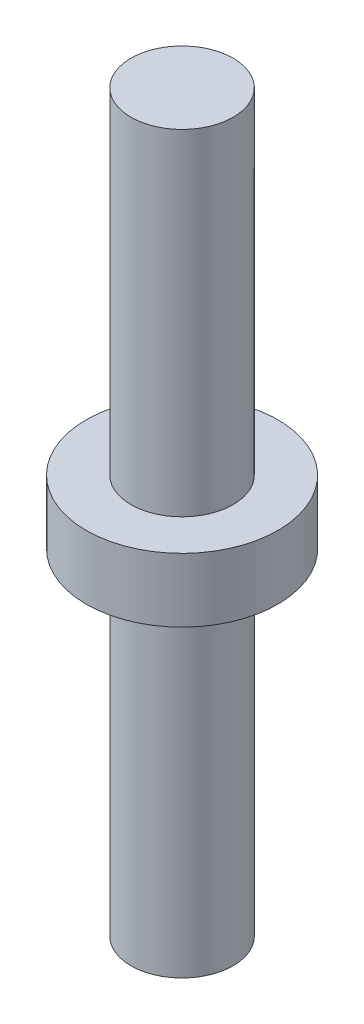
from build123d import *

# Parameters (mm, degrees)
SKETCH_1_R      = 3
EXTRUDE_1_DEPTH = 2
SKETCH_2_R      = 1.6
EXTRUDE_2_DEPTH = 10.5
EXTRUDE_START   = 10.5
SKETCH_3_R      = 1.6
EXTRUDE_3_DEPTH = 10.5


with BuildPart() as part:
    # Sketch 1 → Extrude 1 (new body)
    with BuildSketch(Plane(origin=(0, 0, 0), x_dir=(1, 0, 0), z_dir=(0, 1, 0))):
        with Locations(Location((0, 0, 0), (0, 0, 270))):
            Circle(SKETCH_1_R)
    extrude(amount=EXTRUDE_1_DEPTH)

    # Sketch 2 → Extrude 2 (add)
    with BuildSketch(Plane(origin=(0, 2, 0), x_dir=(1, 0, 0), z_dir=(0, 1, 0))):
        with Locations(Location((0, 0, 0), (0, 0, 90))):
            Circle(SKETCH_2_R)
    extrude(amount=EXTRUDE_2_DEPTH)

    # Sketch 3 → Extrude 3 (add)
    with BuildSketch(Plane.XZ.offset(EXTRUDE_START)):
        with Locations(Location((0, 0, 0), (0, 0, 270))):
            Circle(SKETCH_3_R)
    extrude(amount=-EXTRUDE_3_DEPTH)


solid = part.part
